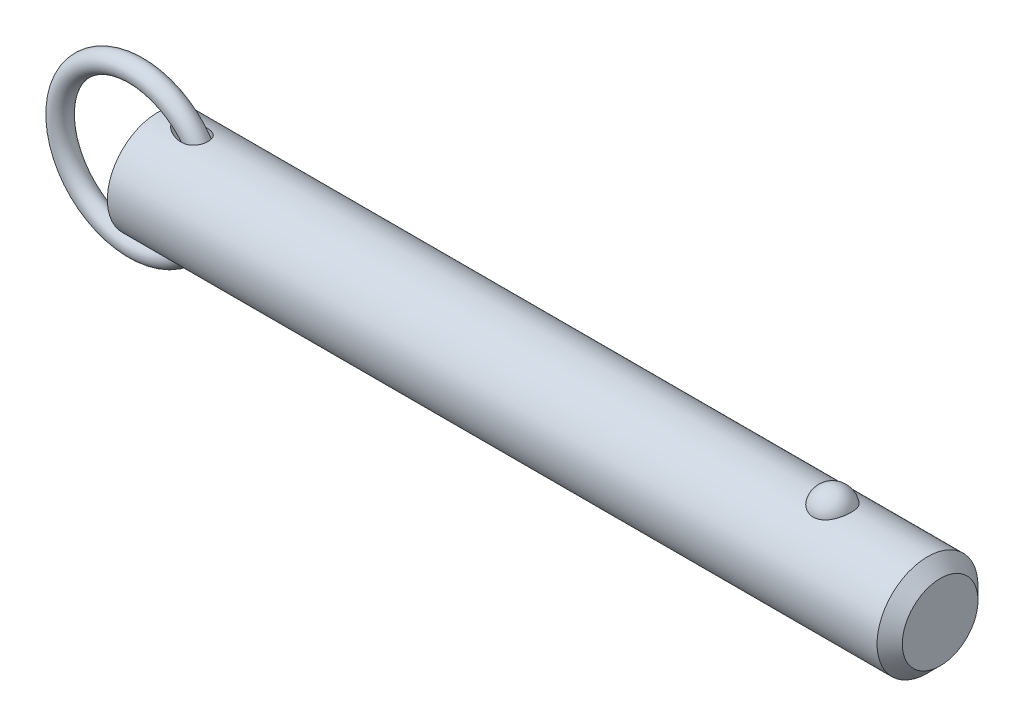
ISO-10303-21;
HEADER;
FILE_DESCRIPTION(('STEP AP214'),'2;1');
FILE_NAME('part.step','',(''),(''),'','','');
FILE_SCHEMA(('AUTOMOTIVE_DESIGN { 1 0 10303 214 1 1 1 1 }'));
ENDSEC;
DATA;
#1=APPLICATION_CONTEXT('core data for automotive mechanical design processes');
#2=APPLICATION_PROTOCOL_DEFINITION('international standard','automotive_design',2000,#1);
#3=PRODUCT_CONTEXT('',#1,'mechanical');
#4=PRODUCT('Part','Part','',(#3));
#5=PRODUCT_RELATED_PRODUCT_CATEGORY('part','',(#4));
#6=PRODUCT_DEFINITION_FORMATION('','',#4);
#7=PRODUCT_DEFINITION_CONTEXT('part definition',#1,'design');
#8=PRODUCT_DEFINITION('design','',#6,#7);
#9=PRODUCT_DEFINITION_SHAPE('','',#8);
#10=(LENGTH_UNIT() NAMED_UNIT(*) SI_UNIT(.MILLI.,.METRE.));
#11=(NAMED_UNIT(*) PLANE_ANGLE_UNIT() SI_UNIT($,.RADIAN.));
#12=(NAMED_UNIT(*) SI_UNIT($,.STERADIAN.) SOLID_ANGLE_UNIT());
#13=UNCERTAINTY_MEASURE_WITH_UNIT(LENGTH_MEASURE(1.E-05),#10,'distance_accuracy_value','');
#14=(GEOMETRIC_REPRESENTATION_CONTEXT(3) GLOBAL_UNCERTAINTY_ASSIGNED_CONTEXT((#13)) GLOBAL_UNIT_ASSIGNED_CONTEXT((#10,
#11,#12)) REPRESENTATION_CONTEXT('',''));
#15=CARTESIAN_POINT('',(0.,0.,0.));
#16=DIRECTION('',(0.,0.,1.));
#17=DIRECTION('',(1.,0.,0.));
#18=AXIS2_PLACEMENT_3D('',#15,#16,#17);
#19=CARTESIAN_POINT('',(-5.53898640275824,0.,0.));
#20=DIRECTION('',(0.,0.,1.));
#21=DIRECTION('',(1.,0.,0.));
#22=AXIS2_PLACEMENT_3D('',#19,#20,#21);
#23=TOROIDAL_SURFACE('',#22,19.05,2.54);
#24=CARTESIAN_POINT('',(16.0510135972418,0.,0.));
#25=VERTEX_POINT('',#24);
#26=VERTEX_LOOP('',#25);
#27=FACE_BOUND('',#26,.T.);
#28=ADVANCED_FACE('P0_F12',(#27),#23,.T.);
#29=CLOSED_SHELL('',(#28));
#30=MANIFOLD_SOLID_BREP('P0_B1',#29);
#31=CARTESIAN_POINT('',(0.,0.,0.));
#32=DIRECTION('',(1.,0.,0.));
#33=DIRECTION('',(0.,0.,-1.));
#34=AXIS2_PLACEMENT_3D('',#31,#32,#33);
#35=CYLINDRICAL_SURFACE('',#34,12.7);
#36=CARTESIAN_POINT('',(193.675,0.,0.));
#37=DIRECTION('',(1.,0.,0.));
#38=DIRECTION('',(0.,0.,-1.));
#39=AXIS2_PLACEMENT_3D('',#36,#37,#38);
#40=CIRCLE('',#39,12.7);
#41=CARTESIAN_POINT('',(193.675,0.,-12.7));
#42=VERTEX_POINT('',#41);
#43=EDGE_CURVE('P1_E89',#42,#42,#40,.T.);
#44=ORIENTED_EDGE('',*,*,#43,.F.);
#45=EDGE_LOOP('',(#44));
#46=FACE_BOUND('',#45,.T.);
#47=CARTESIAN_POINT('',(0.,0.,0.));
#48=DIRECTION('',(1.,0.,0.));
#49=DIRECTION('',(0.,0.,-1.));
#50=AXIS2_PLACEMENT_3D('',#47,#48,#49);
#51=CIRCLE('',#50,12.7);
#52=CARTESIAN_POINT('',(0.,0.,-12.7));
#53=VERTEX_POINT('',#52);
#54=EDGE_CURVE('P1_E52',#53,#53,#51,.T.);
#55=ORIENTED_EDGE('',*,*,#54,.T.);
#56=EDGE_LOOP('',(#55));
#57=FACE_BOUND('',#56,.T.);
#58=CARTESIAN_POINT('',(169.760042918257,11.7500437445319,4.81938502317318));
#59=CARTESIAN_POINT('',(169.635088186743,11.7500430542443,4.81938571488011));
#60=CARTESIAN_POINT('',(169.510144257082,11.7520975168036,4.81438658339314));
#61=CARTESIAN_POINT('',(169.261142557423,11.760253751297,4.79442904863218));
#62=CARTESIAN_POINT('',(169.137085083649,11.7663568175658,4.77946746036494));
#63=CARTESIAN_POINT('',(168.890901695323,11.7824262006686,4.7397141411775));
#64=CARTESIAN_POINT('',(168.768774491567,11.7923898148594,4.71492928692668));
#65=CARTESIAN_POINT('',(168.527187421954,11.8158938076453,4.65571340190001));
#66=CARTESIAN_POINT('',(168.40772859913,11.8294355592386,4.6212786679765));
#67=CARTESIAN_POINT('',(168.172557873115,11.8596812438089,4.54309502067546));
#68=CARTESIAN_POINT('',(168.056839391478,11.8763792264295,4.49936361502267));
#69=CARTESIAN_POINT('',(167.829653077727,11.9124878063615,4.40287235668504));
#70=CARTESIAN_POINT('',(167.718186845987,11.9318994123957,4.35010914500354));
#71=CARTESIAN_POINT('',(167.391278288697,11.9934256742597,4.17881316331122));
#72=CARTESIAN_POINT('',(167.183127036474,12.038858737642,4.04720756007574));
#73=CARTESIAN_POINT('',(166.785850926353,12.1352173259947,3.748564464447));
#74=CARTESIAN_POINT('',(166.597443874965,12.1862630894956,3.58061821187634));
#75=CARTESIAN_POINT('',(166.250521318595,12.2875163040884,3.21600758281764));
#76=CARTESIAN_POINT('',(166.092011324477,12.3377235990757,3.0193379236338));
#77=CARTESIAN_POINT('',(165.80168878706,12.4344923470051,2.592916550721));
#78=CARTESIAN_POINT('',(165.671376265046,12.4807925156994,2.36208286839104));
#79=CARTESIAN_POINT('',(165.449407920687,12.5623454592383,1.88070399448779));
#80=CARTESIAN_POINT('',(165.357755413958,12.5975972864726,1.63015711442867));
#81=CARTESIAN_POINT('',(165.214046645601,12.6538414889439,1.11298869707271));
#82=CARTESIAN_POINT('',(165.162499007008,12.6746503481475,0.846205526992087));
#83=CARTESIAN_POINT('',(165.101977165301,12.699153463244,0.307085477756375));
#84=CARTESIAN_POINT('',(165.093001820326,12.7028481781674,0.0347487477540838));
#85=CARTESIAN_POINT('',(165.117731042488,12.6927785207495,-0.506073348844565));
#86=CARTESIAN_POINT('',(165.151189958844,12.6791146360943,-0.774571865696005));
#87=CARTESIAN_POINT('',(165.259687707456,12.635882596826,-1.30170246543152));
#88=CARTESIAN_POINT('',(165.33472729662,12.606314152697,-1.56033436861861));
#89=CARTESIAN_POINT('',(165.52500006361,12.5342328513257,-2.0608389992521));
#90=CARTESIAN_POINT('',(165.640287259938,12.4917026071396,-2.30268867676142));
#91=CARTESIAN_POINT('',(165.908704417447,12.3981123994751,-2.76259600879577));
#92=CARTESIAN_POINT('',(166.061837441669,12.3470517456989,-2.98065173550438));
#93=CARTESIAN_POINT('',(166.403507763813,12.2416045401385,-3.38786328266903));
#94=CARTESIAN_POINT('',(166.592201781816,12.1872040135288,-3.57688418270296));
#95=CARTESIAN_POINT('',(167.000239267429,12.0814086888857,-3.91941073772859));
#96=CARTESIAN_POINT('',(167.219580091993,12.0300136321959,-4.07291945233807));
#97=CARTESIAN_POINT('',(167.678375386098,11.9373542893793,-4.33691289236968));
#98=CARTESIAN_POINT('',(167.917304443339,11.8958982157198,-4.44824125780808));
#99=CARTESIAN_POINT('',(168.41243761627,11.8268116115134,-4.62881985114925));
#100=CARTESIAN_POINT('',(168.668635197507,11.7991758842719,-4.69808589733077));
#101=CARTESIAN_POINT('',(169.177164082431,11.7622209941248,-4.78983181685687));
#102=CARTESIAN_POINT('',(169.429041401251,11.7520502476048,-4.81449025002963));
#103=CARTESIAN_POINT('',(169.933573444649,11.7485796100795,-4.82295735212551));
#104=CARTESIAN_POINT('',(170.186228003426,11.7552763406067,-4.80677420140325));
#105=CARTESIAN_POINT('',(170.676834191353,11.7842584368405,-4.73525430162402));
#106=CARTESIAN_POINT('',(170.914998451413,11.8060486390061,-4.68116061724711));
#107=CARTESIAN_POINT('',(171.378489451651,11.8622750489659,-4.53678133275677));
#108=CARTESIAN_POINT('',(171.603815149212,11.8967122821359,-4.44649279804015));
#109=CARTESIAN_POINT('',(172.040801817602,11.9754603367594,-4.2298761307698));
#110=CARTESIAN_POINT('',(172.252057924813,12.0199699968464,-4.10280539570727));
#111=CARTESIAN_POINT('',(172.650601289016,12.1138028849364,-3.81685409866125));
#112=CARTESIAN_POINT('',(172.837883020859,12.163127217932,-3.65796622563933));
#113=CARTESIAN_POINT('',(173.193350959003,12.2642343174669,-3.30364864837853));
#114=CARTESIAN_POINT('',(173.360111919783,12.3160165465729,-3.10678783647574));
#115=CARTESIAN_POINT('',(173.659579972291,12.4142566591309,-2.68748409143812));
#116=CARTESIAN_POINT('',(173.792280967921,12.4607135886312,-2.4650365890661));
#117=CARTESIAN_POINT('',(174.024691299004,12.5450236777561,-1.9928951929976));
#118=CARTESIAN_POINT('',(174.123215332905,12.5825557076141,-1.74255918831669));
#119=CARTESIAN_POINT('',(174.279227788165,12.6431720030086,-1.22773734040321));
#120=CARTESIAN_POINT('',(174.336715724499,12.6662560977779,-0.963251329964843));
#121=CARTESIAN_POINT('',(174.409544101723,12.6956486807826,-0.427355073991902));
#122=CARTESIAN_POINT('',(174.424837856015,12.7019385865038,-0.155937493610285));
#123=CARTESIAN_POINT('',(174.412779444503,12.6970201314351,0.38592890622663));
#124=CARTESIAN_POINT('',(174.38542805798,12.6858120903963,0.65637774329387));
#125=CARTESIAN_POINT('',(174.313060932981,12.6568455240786,1.05454017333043));
#126=CARTESIAN_POINT('',(174.283796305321,12.6451962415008,1.185778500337));
#127=CARTESIAN_POINT('',(174.215022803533,12.6181819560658,1.44513808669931));
#128=CARTESIAN_POINT('',(174.175517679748,12.6028183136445,1.57326046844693));
#129=CARTESIAN_POINT('',(174.086439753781,12.5687547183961,1.82554978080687));
#130=CARTESIAN_POINT('',(174.036862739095,12.5500533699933,1.94971503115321));
#131=CARTESIAN_POINT('',(173.92792115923,12.5098093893,2.19314370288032));
#132=CARTESIAN_POINT('',(173.868560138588,12.4882677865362,2.31240887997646));
#133=CARTESIAN_POINT('',(173.73997128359,12.4427679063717,2.5459303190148));
#134=CARTESIAN_POINT('',(173.670688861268,12.4187964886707,2.66015396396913));
#135=CARTESIAN_POINT('',(173.522903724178,12.3691892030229,2.88202659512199));
#136=CARTESIAN_POINT('',(173.444404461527,12.3435539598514,2.98967802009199));
#137=CARTESIAN_POINT('',(173.278550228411,12.2912955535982,3.1977438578));
#138=CARTESIAN_POINT('',(173.191191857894,12.2646720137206,3.298155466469));
#139=CARTESIAN_POINT('',(173.008161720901,12.2111945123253,3.49095035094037));
#140=CARTESIAN_POINT('',(172.912493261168,12.1843406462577,3.58333679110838));
#141=CARTESIAN_POINT('',(172.713627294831,12.1312249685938,3.7592287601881));
#142=CARTESIAN_POINT('',(172.610450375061,12.104961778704,3.84275713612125));
#143=CARTESIAN_POINT('',(172.39701336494,12.0537284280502,4.00056406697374));
#144=CARTESIAN_POINT('',(172.286756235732,12.028757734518,4.07484645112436));
#145=CARTESIAN_POINT('',(172.059755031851,11.9808306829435,4.21367959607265));
#146=CARTESIAN_POINT('',(171.943006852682,11.9578756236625,4.27822410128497));
#147=CARTESIAN_POINT('',(171.70394258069,11.9147184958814,4.39698483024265));
#148=CARTESIAN_POINT('',(171.581628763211,11.894515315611,4.45120522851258));
#149=CARTESIAN_POINT('',(171.322952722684,11.8561129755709,4.55255353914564));
#150=CARTESIAN_POINT('',(171.186223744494,11.8381764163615,4.59884858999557));
#151=CARTESIAN_POINT('',(170.908608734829,11.8069093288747,4.67853897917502));
#152=CARTESIAN_POINT('',(170.767724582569,11.7935767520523,4.71194005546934));
#153=CARTESIAN_POINT('',(170.48309446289,11.7720277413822,4.76552188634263));
#154=CARTESIAN_POINT('',(170.339348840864,11.7638106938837,4.78570422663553));
#155=CARTESIAN_POINT('',(170.050411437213,11.7528195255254,4.81263433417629));
#156=CARTESIAN_POINT('',(169.905219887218,11.7500445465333,4.81938421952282));
#157=CARTESIAN_POINT('',(169.760042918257,11.7500437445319,4.81938502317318));
#158=B_SPLINE_CURVE_WITH_KNOTS('',3,(#58,#59,#60,#61,#62,#63,#64,#65,#66,#67,#68,#69,#70,#71,
#72,#73,#74,#75,#76,#77,#78,#79,#80,#81,#82,#83,#84,#85,#86,#87,#88,#89,#90,#91,#92,#93,#94,#95,
#96,#97,#98,#99,#100,#101,#102,#103,#104,#105,#106,#107,#108,#109,#110,#111,#112,#113,#114,#115,
#116,#117,#118,#119,#120,#121,#122,#123,#124,#125,#126,#127,#128,#129,#130,#131,#132,#133,#134,
#135,#136,#137,#138,#139,#140,#141,#142,#143,#144,#145,#146,#147,#148,#149,#150,#151,#152,#153,
#154,#155,#156,#157),.UNSPECIFIED.,.T.,.F.,(4,2,2,2,2,2,2,2,2,2,2,2,2,2,2,2,2,2,2,2,2,2,2,2,2,2,
2,2,2,2,2,2,2,2,2,2,2,2,2,2,2,2,2,2,2,2,2,2,2,4),(0.,0.374729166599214,0.749578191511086,
1.12416526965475,1.49889629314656,1.87292776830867,2.24709865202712,2.99481328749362,
3.76399449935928,4.53331735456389,5.3368391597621,6.14042986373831,6.95405296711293,
7.76765424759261,8.57656703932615,9.38549455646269,10.1955119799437,11.0055949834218,
11.8193353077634,12.6330054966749,13.4294141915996,14.2255231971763,14.9815786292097,
15.7374826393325,16.4696948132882,17.2019663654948,17.9501979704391,18.6986017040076,
19.4844704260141,20.2704797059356,21.0815215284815,21.8925729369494,22.7045213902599,
23.5164550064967,23.9209608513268,24.3253187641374,24.7298461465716,25.1342272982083,
25.54092555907,25.9474719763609,26.3541750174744,26.7607169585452,27.1661834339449,
27.5714814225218,27.9770386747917,28.3824315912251,28.8181206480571,29.2536155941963,
29.6890582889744,30.1244323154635),.UNSPECIFIED.);
#159=CARTESIAN_POINT('',(169.760042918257,11.7500437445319,4.81938502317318));
#160=VERTEX_POINT('',#159);
#161=EDGE_CURVE('P1_E80',#160,#160,#158,.T.);
#162=ORIENTED_EDGE('',*,*,#161,.T.);
#163=EDGE_LOOP('',(#162));
#164=FACE_BOUND('',#163,.T.);
#165=CARTESIAN_POINT('',(-5.53898640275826,0.,0.));
#166=DIRECTION('',(0.796400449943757,-0.604769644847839,0.));
#167=DIRECTION('',(0.604769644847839,0.796400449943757,0.));
#168=AXIS2_PLACEMENT_3D('',#165,#166,#167);
#169=ELLIPSE('',#168,15.9467514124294,12.7);
#170=CARTESIAN_POINT('',(4.09482149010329,12.6864319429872,0.586893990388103));
#171=VERTEX_POINT('',#170);
#172=CARTESIAN_POINT('',(4.09482149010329,12.6864319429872,-0.586893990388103));
#173=VERTEX_POINT('',#172);
#174=EDGE_CURVE('P1_E47',#171,#173,#169,.F.);
#175=ORIENTED_EDGE('',*,*,#174,.T.);
#176=CARTESIAN_POINT('',(4.0615317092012,12.6905758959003,-0.48916605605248));
#177=CARTESIAN_POINT('',(4.0811137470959,12.6881366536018,-0.552489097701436));
#178=CARTESIAN_POINT('',(4.10417851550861,12.6852663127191,-0.614604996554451));
#179=CARTESIAN_POINT('',(4.15628434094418,12.6787965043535,-0.736067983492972));
#180=CARTESIAN_POINT('',(4.18531032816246,12.6751988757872,-0.795421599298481));
#181=CARTESIAN_POINT('',(4.2791115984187,12.6636052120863,-0.967590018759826));
#182=CARTESIAN_POINT('',(4.35123408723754,12.654730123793,-1.07635920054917));
#183=CARTESIAN_POINT('',(4.49106800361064,12.6376715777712,-1.25922957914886));
#184=CARTESIAN_POINT('',(4.55601066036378,12.6297947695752,-1.33556751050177));
#185=CARTESIAN_POINT('',(4.69223626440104,12.6134116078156,-1.48232741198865));
#186=CARTESIAN_POINT('',(4.76352147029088,12.6049050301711,-1.55274725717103));
#187=CARTESIAN_POINT('',(4.91163946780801,12.587417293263,-1.68868704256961));
#188=CARTESIAN_POINT('',(4.98851399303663,12.5784327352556,-1.75416062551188));
#189=CARTESIAN_POINT('',(5.14630057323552,12.560235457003,-1.88003275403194));
#190=CARTESIAN_POINT('',(5.22721398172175,12.5510226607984,-1.94042957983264));
#191=CARTESIAN_POINT('',(5.45368877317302,12.5256514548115,-2.09966332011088));
#192=CARTESIAN_POINT('',(5.60261616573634,12.5094182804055,-2.19371988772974));
#193=CARTESIAN_POINT('',(5.90795545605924,12.4774211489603,-2.36893890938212));
#194=CARTESIAN_POINT('',(6.064372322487,12.4616575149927,-2.45009264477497));
#195=CARTESIAN_POINT('',(6.3830613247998,12.431227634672,-2.60008249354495));
#196=CARTESIAN_POINT('',(6.54533237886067,12.4165611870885,-2.66892086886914));
#197=CARTESIAN_POINT('',(6.87462618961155,12.3889351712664,-2.79435199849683));
#198=CARTESIAN_POINT('',(7.04164773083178,12.3759751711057,-2.85094785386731));
#199=CARTESIAN_POINT('',(7.38726647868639,12.3518460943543,-2.95377962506));
#200=CARTESIAN_POINT('',(7.56604577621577,12.3407843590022,-2.9994320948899));
#201=CARTESIAN_POINT('',(7.92698692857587,12.3219309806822,-3.07596683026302));
#202=CARTESIAN_POINT('',(8.10914972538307,12.314140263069,-3.1068449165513));
#203=CARTESIAN_POINT('',(8.47511457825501,12.3025918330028,-3.15226850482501));
#204=CARTESIAN_POINT('',(8.65890979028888,12.2988216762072,-3.16686440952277));
#205=CARTESIAN_POINT('',(9.0269608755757,12.2959421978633,-3.17802250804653));
#206=CARTESIAN_POINT('',(9.21121628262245,12.2968292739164,-3.17459864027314));
#207=CARTESIAN_POINT('',(9.61636263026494,12.3045198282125,-3.14471110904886));
#208=CARTESIAN_POINT('',(9.83695552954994,12.3125080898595,-3.1136323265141));
#209=CARTESIAN_POINT('',(10.1619126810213,12.3303028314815,-3.04206574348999));
#210=CARTESIAN_POINT('',(10.2692747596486,12.3372061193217,-3.01403983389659));
#211=CARTESIAN_POINT('',(10.4811758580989,12.3528538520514,-2.94925947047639));
#212=CARTESIAN_POINT('',(10.5857162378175,12.361597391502,-2.91250930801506));
#213=CARTESIAN_POINT('',(10.7921321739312,12.3808585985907,-2.82951748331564));
#214=CARTESIAN_POINT('',(10.8939665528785,12.3913944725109,-2.78317723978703));
#215=CARTESIAN_POINT('',(11.0926118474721,12.4138762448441,-2.68112002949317));
#216=CARTESIAN_POINT('',(11.1894254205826,12.4258213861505,-2.62540809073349));
#217=CARTESIAN_POINT('',(11.3768740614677,12.4507225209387,-2.50465655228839));
#218=CARTESIAN_POINT('',(11.46751150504,12.4636781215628,-2.43962056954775));
#219=CARTESIAN_POINT('',(11.6414572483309,12.4901070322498,-2.30048560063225));
#220=CARTESIAN_POINT('',(11.7247669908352,12.5035802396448,-2.2263884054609));
#221=CARTESIAN_POINT('',(11.8713131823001,12.5285000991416,-2.08117367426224));
#222=CARTESIAN_POINT('',(11.9357009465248,12.5399538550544,-2.0112159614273));
#223=CARTESIAN_POINT('',(12.0576805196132,12.5624496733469,-1.86555293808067));
#224=CARTESIAN_POINT('',(12.1152732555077,12.5734917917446,-1.7898484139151));
#225=CARTESIAN_POINT('',(12.223073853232,12.5947858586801,-1.63327883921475));
#226=CARTESIAN_POINT('',(12.2732844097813,12.6050380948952,-1.55241568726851));
#227=CARTESIAN_POINT('',(12.3658430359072,12.6243983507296,-1.38621267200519));
#228=CARTESIAN_POINT('',(12.4081916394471,12.6335064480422,-1.30087311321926));
#229=CARTESIAN_POINT('',(12.5150098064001,12.6569076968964,-1.05702619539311));
#230=CARTESIAN_POINT('',(12.5703399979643,12.6695746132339,-0.894232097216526));
#231=CARTESIAN_POINT('',(12.6526225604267,12.6886816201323,-0.561391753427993));
#232=CARTESIAN_POINT('',(12.6795825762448,12.6951233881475,-0.391347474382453));
#233=CARTESIAN_POINT('',(12.7041016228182,12.7009766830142,-0.0537636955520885));
#234=CARTESIAN_POINT('',(12.7024538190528,12.7005778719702,0.113714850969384));
#235=CARTESIAN_POINT('',(12.6717240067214,12.6932548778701,0.445979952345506));
#236=CARTESIAN_POINT('',(12.6426435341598,12.6863310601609,0.61076665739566));
#237=CARTESIAN_POINT('',(12.5579769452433,12.6667465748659,0.932429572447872));
#238=CARTESIAN_POINT('',(12.5024793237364,12.6541050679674,1.08933027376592));
#239=CARTESIAN_POINT('',(12.3665691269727,12.6244558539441,1.39146752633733));
#240=CARTESIAN_POINT('',(12.2861577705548,12.6074483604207,1.53670464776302));
#241=CARTESIAN_POINT('',(12.1018203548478,12.5706804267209,1.81319588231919));
#242=CARTESIAN_POINT('',(11.99765881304,12.5508932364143,1.94428915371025));
#243=CARTESIAN_POINT('',(11.7695265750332,12.5107540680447,2.18776051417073));
#244=CARTESIAN_POINT('',(11.6455540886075,12.4904020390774,2.30013691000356));
#245=CARTESIAN_POINT('',(11.3759347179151,12.4502278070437,2.50870972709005));
#246=CARTESIAN_POINT('',(11.2295880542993,12.4304654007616,2.60400962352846));
#247=CARTESIAN_POINT('',(10.9239803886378,12.3941696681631,2.7716292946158));
#248=CARTESIAN_POINT('',(10.7647152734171,12.3776373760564,2.84394171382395));
#249=CARTESIAN_POINT('',(10.4192039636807,12.3473062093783,2.9730352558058));
#250=CARTESIAN_POINT('',(10.2319332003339,12.3340204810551,3.02717164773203));
#251=CARTESIAN_POINT('',(9.85152982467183,12.3134301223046,3.10986173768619));
#252=CARTESIAN_POINT('',(9.65839336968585,12.3061295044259,3.13839827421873));
#253=CARTESIAN_POINT('',(9.31022514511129,12.2982822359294,3.16897517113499));
#254=CARTESIAN_POINT('',(9.15555718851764,12.2966525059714,3.1752689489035));
#255=CARTESIAN_POINT('',(8.84618945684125,12.2967963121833,3.17471335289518));
#256=CARTESIAN_POINT('',(8.69148970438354,12.2985715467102,3.16785742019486));
#257=CARTESIAN_POINT('',(8.38280471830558,12.3051648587,3.14214692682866));
#258=CARTESIAN_POINT('',(8.22882218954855,12.3099904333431,3.12326280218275));
#259=CARTESIAN_POINT('',(7.92276070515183,12.3222644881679,3.07448013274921));
#260=CARTESIAN_POINT('',(7.7706814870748,12.3297126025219,3.04458312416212));
#261=CARTESIAN_POINT('',(7.4645266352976,12.3470493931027,2.97350781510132));
#262=CARTESIAN_POINT('',(7.3105271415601,12.3570043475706,2.93201910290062));
#263=CARTESIAN_POINT('',(7.00579083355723,12.3787609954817,2.83876185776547));
#264=CARTESIAN_POINT('',(6.85505451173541,12.3905629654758,2.78699178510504));
#265=CARTESIAN_POINT('',(6.55781208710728,12.415528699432,2.67357744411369));
#266=CARTESIAN_POINT('',(6.41129783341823,12.4286895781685,2.61195394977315));
#267=CARTESIAN_POINT('',(6.12302950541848,12.4559398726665,2.47874512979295));
#268=CARTESIAN_POINT('',(5.98127390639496,12.4700289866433,2.40716303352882));
#269=CARTESIAN_POINT('',(5.67073126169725,12.5020754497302,2.23550426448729));
#270=CARTESIAN_POINT('',(5.50343839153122,12.5201625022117,2.13268685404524));
#271=CARTESIAN_POINT('',(5.26147616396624,12.5471537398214,1.96522579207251));
#272=CARTESIAN_POINT('',(5.18224299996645,12.5561365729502,1.9071344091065));
#273=CARTESIAN_POINT('',(5.02746475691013,12.573912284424,1.78618989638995));
#274=CARTESIAN_POINT('',(4.95191912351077,12.5827051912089,1.72333748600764));
#275=CARTESIAN_POINT('',(4.81787163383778,12.598469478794,1.6036086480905));
#276=CARTESIAN_POINT('',(4.75865966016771,12.6054958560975,1.54753994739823));
#277=CARTESIAN_POINT('',(4.64406285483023,12.6191906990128,1.43158546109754));
#278=CARTESIAN_POINT('',(4.58867926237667,12.6258590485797,1.37169845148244));
#279=CARTESIAN_POINT('',(4.4301491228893,12.6450546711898,1.18656670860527));
#280=CARTESIAN_POINT('',(4.33372726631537,12.6568788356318,1.05507993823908));
#281=CARTESIAN_POINT('',(4.2125205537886,12.6718304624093,0.848052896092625));
#282=CARTESIAN_POINT('',(4.1766015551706,12.6762773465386,0.77910002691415));
#283=CARTESIAN_POINT('',(4.1126497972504,12.6842122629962,0.637080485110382));
#284=CARTESIAN_POINT('',(4.08466792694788,12.6876941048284,0.563990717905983));
#285=CARTESIAN_POINT('',(4.0615317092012,12.6905758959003,0.489166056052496));
#286=B_SPLINE_CURVE_WITH_KNOTS('',3,(#176,#177,#178,#179,#180,#181,#182,#183,#184,#185,#186,
#187,#188,#189,#190,#191,#192,#193,#194,#195,#196,#197,#198,#199,#200,#201,#202,#203,#204,#205,
#206,#207,#208,#209,#210,#211,#212,#213,#214,#215,#216,#217,#218,#219,#220,#221,#222,#223,#224,
#225,#226,#227,#228,#229,#230,#231,#232,#233,#234,#235,#236,#237,#238,#239,#240,#241,#242,#243,
#244,#245,#246,#247,#248,#249,#250,#251,#252,#253,#254,#255,#256,#257,#258,#259,#260,#261,#262,
#263,#264,#265,#266,#267,#268,#269,#270,#271,#272,#273,#274,#275,#276,#277,#278,#279,#280,#281,
#282,#283,#284,#285),.UNSPECIFIED.,.F.,.F.,(4,2,2,2,2,2,2,2,2,2,2,2,2,2,2,2,2,2,2,2,2,2,2,2,2,2,
2,2,2,2,2,2,2,2,2,2,2,2,2,2,2,2,2,2,2,2,2,2,2,2,2,2,2,2,4),(0.,0.198708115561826,
0.39691995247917,0.787580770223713,1.08882492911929,1.39017679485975,1.69407136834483,
1.99806847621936,2.52793143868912,3.05815092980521,3.58827293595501,4.11826050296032,
4.67218806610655,5.22627222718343,5.77863637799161,6.3305733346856,6.99657211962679,
7.32977411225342,7.66281254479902,7.99946156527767,8.33593054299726,8.67226935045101,
9.00854178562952,9.29544181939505,9.58230266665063,9.86905853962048,10.1557949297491,
10.6702338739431,11.1845341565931,11.6845985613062,12.1846349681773,12.6830079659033,
13.1813565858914,13.68487951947,14.1884479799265,14.713533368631,15.2387866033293,
15.8228373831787,16.407279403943,16.871081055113,17.3351141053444,17.8002921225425,
18.2654052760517,18.7444169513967,19.2235004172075,19.701586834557,20.1795185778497,
20.7699825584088,21.0658110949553,21.3615950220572,21.606957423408,21.8523988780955,
22.3397467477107,22.5729183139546,22.8075527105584),.UNSPECIFIED.);
#287=EDGE_CURVE('P1_E51',#173,#171,#286,.T.);
#288=ORIENTED_EDGE('',*,*,#287,.T.);
#289=EDGE_LOOP('',(#175,#288));
#290=FACE_BOUND('',#289,.T.);
#291=CARTESIAN_POINT('',(-5.53898640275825,0.,0.));
#292=DIRECTION('',(-0.796400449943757,-0.604769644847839,0.));
#293=DIRECTION('',(0.604769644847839,-0.796400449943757,0.));
#294=AXIS2_PLACEMENT_3D('',#291,#292,#293);
#295=ELLIPSE('',#294,15.9467514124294,12.7);
#296=CARTESIAN_POINT('',(4.0948214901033,-12.6864319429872,0.586893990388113));
#297=VERTEX_POINT('',#296);
#298=CARTESIAN_POINT('',(4.0948214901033,-12.6864319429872,-0.586893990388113));
#299=VERTEX_POINT('',#298);
#300=EDGE_CURVE('P1_E28',#297,#299,#295,.F.);
#301=ORIENTED_EDGE('',*,*,#300,.F.);
#302=CARTESIAN_POINT('',(4.0615317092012,-12.6905758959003,0.489166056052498));
#303=CARTESIAN_POINT('',(4.0811137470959,-12.6881366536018,0.552489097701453));
#304=CARTESIAN_POINT('',(4.10417851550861,-12.6852663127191,0.614604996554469));
#305=CARTESIAN_POINT('',(4.15628434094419,-12.6787965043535,0.736067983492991));
#306=CARTESIAN_POINT('',(4.18531032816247,-12.6751988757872,0.795421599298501));
#307=CARTESIAN_POINT('',(4.27911159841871,-12.6636052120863,0.967590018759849));
#308=CARTESIAN_POINT('',(4.35123408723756,-12.654730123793,1.07635920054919));
#309=CARTESIAN_POINT('',(4.49106800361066,-12.6376715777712,1.25922957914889));
#310=CARTESIAN_POINT('',(4.5560106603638,-12.6297947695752,1.3355675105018));
#311=CARTESIAN_POINT('',(4.69223626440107,-12.6134116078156,1.48232741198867));
#312=CARTESIAN_POINT('',(4.76352147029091,-12.6049050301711,1.55274725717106));
#313=CARTESIAN_POINT('',(4.91163946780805,-12.587417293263,1.68868704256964));
#314=CARTESIAN_POINT('',(4.98851399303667,-12.5784327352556,1.75416062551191));
#315=CARTESIAN_POINT('',(5.14630057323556,-12.560235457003,1.88003275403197));
#316=CARTESIAN_POINT('',(5.22721398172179,-12.5510226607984,1.94042957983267));
#317=CARTESIAN_POINT('',(5.45368877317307,-12.5256514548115,2.09966332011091));
#318=CARTESIAN_POINT('',(5.60261616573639,-12.5094182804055,2.19371988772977));
#319=CARTESIAN_POINT('',(5.9079554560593,-12.4774211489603,2.36893890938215));
#320=CARTESIAN_POINT('',(6.06437232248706,-12.4616575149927,2.450092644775));
#321=CARTESIAN_POINT('',(6.38306132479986,-12.431227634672,2.60008249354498));
#322=CARTESIAN_POINT('',(6.54533237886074,-12.4165611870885,2.66892086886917));
#323=CARTESIAN_POINT('',(6.87462618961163,-12.3889351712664,2.79435199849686));
#324=CARTESIAN_POINT('',(7.04164773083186,-12.3759751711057,2.85094785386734));
#325=CARTESIAN_POINT('',(7.38726647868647,-12.3518460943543,2.95377962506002));
#326=CARTESIAN_POINT('',(7.56604577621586,-12.3407843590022,2.99943209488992));
#327=CARTESIAN_POINT('',(7.92698692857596,-12.3219309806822,3.07596683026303));
#328=CARTESIAN_POINT('',(8.10914972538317,-12.314140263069,3.10684491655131));
#329=CARTESIAN_POINT('',(8.47511457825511,-12.3025918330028,3.15226850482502));
#330=CARTESIAN_POINT('',(8.65890979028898,-12.2988216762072,3.16686440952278));
#331=CARTESIAN_POINT('',(9.0269608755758,-12.2959421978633,3.17802250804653));
#332=CARTESIAN_POINT('',(9.21121628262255,-12.2968292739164,3.17459864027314));
#333=CARTESIAN_POINT('',(9.61636263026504,-12.3045198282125,3.14471110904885));
#334=CARTESIAN_POINT('',(9.83695552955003,-12.3125080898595,3.11363232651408));
#335=CARTESIAN_POINT('',(10.1619126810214,-12.3303028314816,3.04206574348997));
#336=CARTESIAN_POINT('',(10.2692747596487,-12.3372061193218,3.01403983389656));
#337=CARTESIAN_POINT('',(10.481175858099,-12.3528538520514,2.94925947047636));
#338=CARTESIAN_POINT('',(10.5857162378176,-12.361597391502,2.91250930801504));
#339=CARTESIAN_POINT('',(10.7921321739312,-12.3808585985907,2.82951748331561));
#340=CARTESIAN_POINT('',(10.8939665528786,-12.3913944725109,2.78317723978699));
#341=CARTESIAN_POINT('',(11.0926118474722,-12.4138762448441,2.68112002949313));
#342=CARTESIAN_POINT('',(11.1894254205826,-12.4258213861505,2.62540809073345));
#343=CARTESIAN_POINT('',(11.3768740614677,-12.4507225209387,2.50465655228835));
#344=CARTESIAN_POINT('',(11.4675115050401,-12.4636781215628,2.43962056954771));
#345=CARTESIAN_POINT('',(11.641457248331,-12.4901070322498,2.30048560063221));
#346=CARTESIAN_POINT('',(11.7247669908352,-12.5035802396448,2.22638840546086));
#347=CARTESIAN_POINT('',(11.8713131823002,-12.5285000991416,2.0811736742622));
#348=CARTESIAN_POINT('',(11.9357009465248,-12.5399538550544,2.01121596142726));
#349=CARTESIAN_POINT('',(12.0576805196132,-12.5624496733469,1.86555293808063));
#350=CARTESIAN_POINT('',(12.1152732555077,-12.5734917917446,1.78984841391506));
#351=CARTESIAN_POINT('',(12.2230738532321,-12.5947858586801,1.63327883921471));
#352=CARTESIAN_POINT('',(12.2732844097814,-12.6050380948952,1.55241568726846));
#353=CARTESIAN_POINT('',(12.3658430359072,-12.6243983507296,1.38621267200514));
#354=CARTESIAN_POINT('',(12.4081916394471,-12.6335064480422,1.30087311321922));
#355=CARTESIAN_POINT('',(12.5150098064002,-12.6569076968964,1.05702619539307));
#356=CARTESIAN_POINT('',(12.5703399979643,-12.6695746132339,0.894232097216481));
#357=CARTESIAN_POINT('',(12.6526225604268,-12.6886816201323,0.561391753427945));
#358=CARTESIAN_POINT('',(12.6795825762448,-12.6951233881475,0.391347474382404));
#359=CARTESIAN_POINT('',(12.7041016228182,-12.7009766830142,0.05376369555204));
#360=CARTESIAN_POINT('',(12.7024538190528,-12.7005778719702,-0.113714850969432));
#361=CARTESIAN_POINT('',(12.6717240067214,-12.6932548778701,-0.445979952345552));
#362=CARTESIAN_POINT('',(12.6426435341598,-12.6863310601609,-0.610766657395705));
#363=CARTESIAN_POINT('',(12.5579769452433,-12.6667465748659,-0.932429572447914));
#364=CARTESIAN_POINT('',(12.5024793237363,-12.6541050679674,-1.08933027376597));
#365=CARTESIAN_POINT('',(12.3665691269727,-12.6244558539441,-1.39146752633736));
#366=CARTESIAN_POINT('',(12.2861577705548,-12.6074483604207,-1.53670464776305));
#367=CARTESIAN_POINT('',(12.1018203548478,-12.5706804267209,-1.81319588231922));
#368=CARTESIAN_POINT('',(11.99765881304,-12.5508932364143,-1.94428915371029));
#369=CARTESIAN_POINT('',(11.7695265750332,-12.5107540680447,-2.18776051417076));
#370=CARTESIAN_POINT('',(11.6455540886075,-12.4904020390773,-2.30013691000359));
#371=CARTESIAN_POINT('',(11.375934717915,-12.4502278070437,-2.50870972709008));
#372=CARTESIAN_POINT('',(11.2295880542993,-12.4304654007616,-2.60400962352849));
#373=CARTESIAN_POINT('',(10.9239803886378,-12.3941696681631,-2.77162929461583));
#374=CARTESIAN_POINT('',(10.764715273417,-12.3776373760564,-2.84394171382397));
#375=CARTESIAN_POINT('',(10.4192039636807,-12.3473062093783,-2.97303525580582));
#376=CARTESIAN_POINT('',(10.2319332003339,-12.3340204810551,-3.02717164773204));
#377=CARTESIAN_POINT('',(9.85152982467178,-12.3134301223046,-3.1098617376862));
#378=CARTESIAN_POINT('',(9.6583933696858,-12.3061295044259,-3.13839827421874));
#379=CARTESIAN_POINT('',(9.31022514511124,-12.2982822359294,-3.168975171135));
#380=CARTESIAN_POINT('',(9.15555718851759,-12.2966525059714,-3.1752689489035));
#381=CARTESIAN_POINT('',(8.8461894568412,-12.2967963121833,-3.17471335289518));
#382=CARTESIAN_POINT('',(8.69148970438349,-12.2985715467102,-3.16785742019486));
#383=CARTESIAN_POINT('',(8.38280471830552,-12.3051648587,-3.14214692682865));
#384=CARTESIAN_POINT('',(8.22882218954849,-12.3099904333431,-3.12326280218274));
#385=CARTESIAN_POINT('',(7.92276070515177,-12.3222644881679,-3.07448013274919));
#386=CARTESIAN_POINT('',(7.77068148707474,-12.329712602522,-3.04458312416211));
#387=CARTESIAN_POINT('',(7.46452663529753,-12.3470493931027,-2.97350781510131));
#388=CARTESIAN_POINT('',(7.31052714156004,-12.3570043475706,-2.9320191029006));
#389=CARTESIAN_POINT('',(7.00579083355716,-12.3787609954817,-2.83876185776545));
#390=CARTESIAN_POINT('',(6.85505451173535,-12.3905629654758,-2.78699178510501));
#391=CARTESIAN_POINT('',(6.55781208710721,-12.415528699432,-2.67357744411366));
#392=CARTESIAN_POINT('',(6.41129783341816,-12.4286895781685,-2.61195394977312));
#393=CARTESIAN_POINT('',(6.12302950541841,-12.4559398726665,-2.47874512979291));
#394=CARTESIAN_POINT('',(5.98127390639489,-12.4700289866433,-2.40716303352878));
#395=CARTESIAN_POINT('',(5.67073126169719,-12.5020754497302,-2.23550426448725));
#396=CARTESIAN_POINT('',(5.50343839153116,-12.5201625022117,-2.1326868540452));
#397=CARTESIAN_POINT('',(5.26147616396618,-12.5471537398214,-1.96522579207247));
#398=CARTESIAN_POINT('',(5.1822429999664,-12.5561365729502,-1.90713440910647));
#399=CARTESIAN_POINT('',(5.02746475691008,-12.573912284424,-1.78618989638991));
#400=CARTESIAN_POINT('',(4.95191912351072,-12.5827051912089,-1.7233374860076));
#401=CARTESIAN_POINT('',(4.81787163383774,-12.598469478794,-1.60360864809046));
#402=CARTESIAN_POINT('',(4.75865966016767,-12.6054958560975,-1.54753994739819));
#403=CARTESIAN_POINT('',(4.64406285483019,-12.6191906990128,-1.43158546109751));
#404=CARTESIAN_POINT('',(4.58867926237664,-12.6258590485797,-1.37169845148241));
#405=CARTESIAN_POINT('',(4.43014912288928,-12.6450546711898,-1.18656670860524));
#406=CARTESIAN_POINT('',(4.33372726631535,-12.6568788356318,-1.05507993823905));
#407=CARTESIAN_POINT('',(4.21252055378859,-12.6718304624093,-0.8480528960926));
#408=CARTESIAN_POINT('',(4.17660155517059,-12.6762773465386,-0.779100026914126));
#409=CARTESIAN_POINT('',(4.11264979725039,-12.6842122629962,-0.637080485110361));
#410=CARTESIAN_POINT('',(4.08466792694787,-12.6876941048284,-0.563990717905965));
#411=CARTESIAN_POINT('',(4.0615317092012,-12.6905758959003,-0.489166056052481));
#412=B_SPLINE_CURVE_WITH_KNOTS('',3,(#302,#303,#304,#305,#306,#307,#308,#309,#310,#311,#312,
#313,#314,#315,#316,#317,#318,#319,#320,#321,#322,#323,#324,#325,#326,#327,#328,#329,#330,#331,
#332,#333,#334,#335,#336,#337,#338,#339,#340,#341,#342,#343,#344,#345,#346,#347,#348,#349,#350,
#351,#352,#353,#354,#355,#356,#357,#358,#359,#360,#361,#362,#363,#364,#365,#366,#367,#368,#369,
#370,#371,#372,#373,#374,#375,#376,#377,#378,#379,#380,#381,#382,#383,#384,#385,#386,#387,#388,
#389,#390,#391,#392,#393,#394,#395,#396,#397,#398,#399,#400,#401,#402,#403,#404,#405,#406,#407,
#408,#409,#410,#411),.UNSPECIFIED.,.F.,.F.,(4,2,2,2,2,2,2,2,2,2,2,2,2,2,2,2,2,2,2,2,2,2,2,2,2,2,
2,2,2,2,2,2,2,2,2,2,2,2,2,2,2,2,2,2,2,2,2,2,2,2,2,2,2,2,4),(0.,0.198708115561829,
0.396919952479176,0.787580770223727,1.08882492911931,1.39017679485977,1.69407136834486,
1.9980684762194,2.52793143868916,3.05815092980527,3.58827293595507,4.11826050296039,
4.67218806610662,5.22627222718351,5.77863637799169,6.33057333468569,6.99657211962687,
7.32977411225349,7.66281254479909,7.99946156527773,8.33593054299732,8.67226935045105,
9.00854178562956,9.29544181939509,9.58230266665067,9.86905853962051,10.1557949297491,
10.6702338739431,11.1845341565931,11.6845985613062,12.1846349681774,12.6830079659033,
13.1813565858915,13.68487951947,14.1884479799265,14.7135333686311,15.2387866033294,
15.8228373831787,16.4072794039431,16.871081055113,17.3351141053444,17.8002921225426,
18.2654052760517,18.7444169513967,19.2235004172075,19.701586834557,20.1795185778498,
20.7699825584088,21.0658110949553,21.3615950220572,21.606957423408,21.8523988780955,
22.3397467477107,22.5729183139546,22.8075527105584),.UNSPECIFIED.);
#413=EDGE_CURVE('P1_E10',#297,#299,#412,.T.);
#414=ORIENTED_EDGE('',*,*,#413,.T.);
#415=EDGE_LOOP('',(#301,#414));
#416=FACE_BOUND('',#415,.T.);
#417=ADVANCED_FACE('P1_F15',(#46,#57,#164,#290,#416),#35,.T.);
#418=CARTESIAN_POINT('',(0.,0.,0.));
#419=DIRECTION('',(-1.,0.,0.));
#420=DIRECTION('',(0.,0.,1.));
#421=AXIS2_PLACEMENT_3D('',#418,#419,#420);
#422=PLANE('',#421);
#423=ORIENTED_EDGE('',*,*,#54,.F.);
#424=EDGE_LOOP('',(#423));
#425=FACE_BOUND('',#424,.T.);
#426=ADVANCED_FACE('P1_F17',(#425),#422,.T.);
#427=CARTESIAN_POINT('',(196.85,0.,0.));
#428=DIRECTION('',(-1.,0.,0.));
#429=DIRECTION('',(0.,0.,1.));
#430=AXIS2_PLACEMENT_3D('',#427,#428,#429);
#431=CONICAL_SURFACE('',#430,9.52500000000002,0.785398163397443);
#432=ORIENTED_EDGE('',*,*,#43,.T.);
#433=EDGE_LOOP('',(#432));
#434=FACE_BOUND('',#433,.T.);
#435=CARTESIAN_POINT('',(196.85,0.,0.));
#436=DIRECTION('',(1.,0.,0.));
#437=DIRECTION('',(0.,0.,-1.));
#438=AXIS2_PLACEMENT_3D('',#435,#436,#437);
#439=CIRCLE('',#438,9.52500000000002);
#440=CARTESIAN_POINT('',(196.85,0.,-9.52500000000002));
#441=VERTEX_POINT('',#440);
#442=EDGE_CURVE('P1_E86',#441,#441,#439,.T.);
#443=ORIENTED_EDGE('',*,*,#442,.F.);
#444=EDGE_LOOP('',(#443));
#445=FACE_BOUND('',#444,.T.);
#446=ADVANCED_FACE('P1_F105',(#434,#445),#431,.T.);
#447=CARTESIAN_POINT('',(196.85,9.52500000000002,0.));
#448=DIRECTION('',(1.,0.,0.));
#449=DIRECTION('',(0.,0.,-1.));
#450=AXIS2_PLACEMENT_3D('',#447,#448,#449);
#451=PLANE('',#450);
#452=ORIENTED_EDGE('',*,*,#442,.T.);
#453=EDGE_LOOP('',(#452));
#454=FACE_BOUND('',#453,.T.);
#455=ADVANCED_FACE('P1_F78',(#454),#451,.T.);
#456=CARTESIAN_POINT('',(169.760042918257,11.43,0.));
#457=DIRECTION('',(-1.,0.,0.));
#458=DIRECTION('',(0.,-1.,0.));
#459=AXIS2_PLACEMENT_3D('',#456,#457,#458);
#460=SPHERICAL_SURFACE('',#459,4.83);
#461=ORIENTED_EDGE('',*,*,#161,.F.);
#462=EDGE_LOOP('',(#461));
#463=FACE_BOUND('',#462,.T.);
#464=ADVANCED_FACE('P1_F71',(#463),#460,.T.);
#465=CARTESIAN_POINT('',(-5.53898640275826,0.,0.));
#466=DIRECTION('',(0.,0.,1.));
#467=DIRECTION('',(1.,0.,0.));
#468=AXIS2_PLACEMENT_3D('',#465,#466,#467);
#469=TOROIDAL_SURFACE('',#468,19.05,3.175);
#470=CARTESIAN_POINT('',(5.98187533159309,-15.1714285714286,0.));
#471=DIRECTION('',(-0.796400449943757,-0.604769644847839,0.));
#472=DIRECTION('',(0.604769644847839,-0.796400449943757,0.));
#473=AXIS2_PLACEMENT_3D('',#470,#471,#472);
#474=CIRCLE('',#473,3.175);
#475=EDGE_CURVE('P1_E34',#297,#299,#474,.T.);
#476=ORIENTED_EDGE('',*,*,#475,.T.);
#477=ORIENTED_EDGE('',*,*,#413,.F.);
#478=EDGE_LOOP('',(#476,#477));
#479=FACE_BOUND('',#478,.T.);
#480=CARTESIAN_POINT('',(5.98187533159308,15.1714285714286,0.));
#481=DIRECTION('',(0.796400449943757,-0.604769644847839,0.));
#482=DIRECTION('',(0.604769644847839,0.796400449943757,0.));
#483=AXIS2_PLACEMENT_3D('',#480,#481,#482);
#484=CIRCLE('',#483,3.175);
#485=EDGE_CURVE('P1_E41',#171,#173,#484,.T.);
#486=ORIENTED_EDGE('',*,*,#485,.F.);
#487=ORIENTED_EDGE('',*,*,#287,.F.);
#488=EDGE_LOOP('',(#486,#487));
#489=FACE_BOUND('',#488,.T.);
#490=ADVANCED_FACE('P1_F55',(#479,#489),#469,.F.);
#491=CARTESIAN_POINT('',(5.98187533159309,-15.1714285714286,0.));
#492=DIRECTION('',(-0.796400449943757,-0.604769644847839,0.));
#493=DIRECTION('',(0.604769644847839,-0.796400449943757,0.));
#494=AXIS2_PLACEMENT_3D('',#491,#492,#493);
#495=PLANE('',#494);
#496=ORIENTED_EDGE('',*,*,#300,.T.);
#497=ORIENTED_EDGE('',*,*,#475,.F.);
#498=EDGE_LOOP('',(#496,#497));
#499=FACE_BOUND('',#498,.T.);
#500=ADVANCED_FACE('P1_F70',(#499),#495,.F.);
#501=CARTESIAN_POINT('',(5.98187533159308,15.1714285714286,0.));
#502=DIRECTION('',(0.796400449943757,-0.604769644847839,0.));
#503=DIRECTION('',(0.604769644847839,0.796400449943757,0.));
#504=AXIS2_PLACEMENT_3D('',#501,#502,#503);
#505=PLANE('',#504);
#506=ORIENTED_EDGE('',*,*,#485,.T.);
#507=ORIENTED_EDGE('',*,*,#174,.F.);
#508=EDGE_LOOP('',(#506,#507));
#509=FACE_BOUND('',#508,.T.);
#510=ADVANCED_FACE('P1_F48',(#509),#505,.T.);
#511=CLOSED_SHELL('',(#417,#426,#446,#455,#464,#490,#500,#510));
#512=MANIFOLD_SOLID_BREP('P1_B1',#511);
#513=ADVANCED_BREP_SHAPE_REPRESENTATION('',(#18,#30,#512),#14);
#514=SHAPE_DEFINITION_REPRESENTATION(#9,#513);
ENDSEC;
END-ISO-10303-21;
